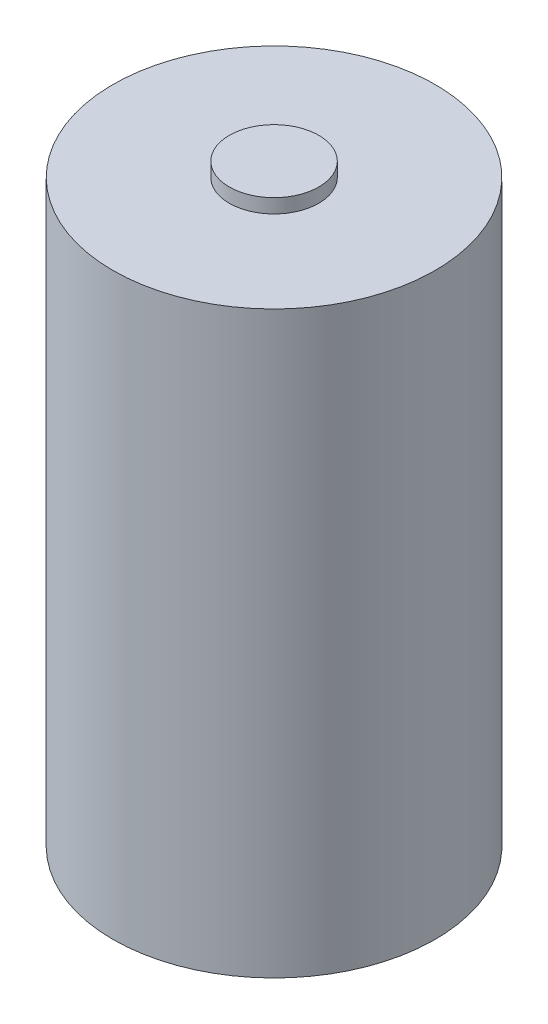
from build123d import *

# Parameters (mm, degrees)
SKETCH1_R      = 17.1
EXTRUDE1_DEPTH = 61.5
SKETCH2_R      = 4.75
EXTRUDE2_DEPTH = 1.5


with BuildPart() as part:
    # Sketch1 → Extrude1 (new body)
    with BuildSketch(Plane(origin=(0, 0, 0), x_dir=(1, 0, 0), z_dir=(0, 1, 0))):
        with Locations(Location((0, 0, 0), (0, 0, 270))):
            Circle(SKETCH1_R)
    extrude(amount=EXTRUDE1_DEPTH)

    # Sketch2 → Extrude2 (add)
    with BuildSketch(Plane(origin=(0, 61.5, 0), x_dir=(-1, 0, 0), z_dir=(0, 1, 0))):
        with Locations(Location((0, 0, 0), (0, 0, 90))):
            Circle(SKETCH2_R)
    extrude(amount=EXTRUDE2_DEPTH)


solid = part.part
